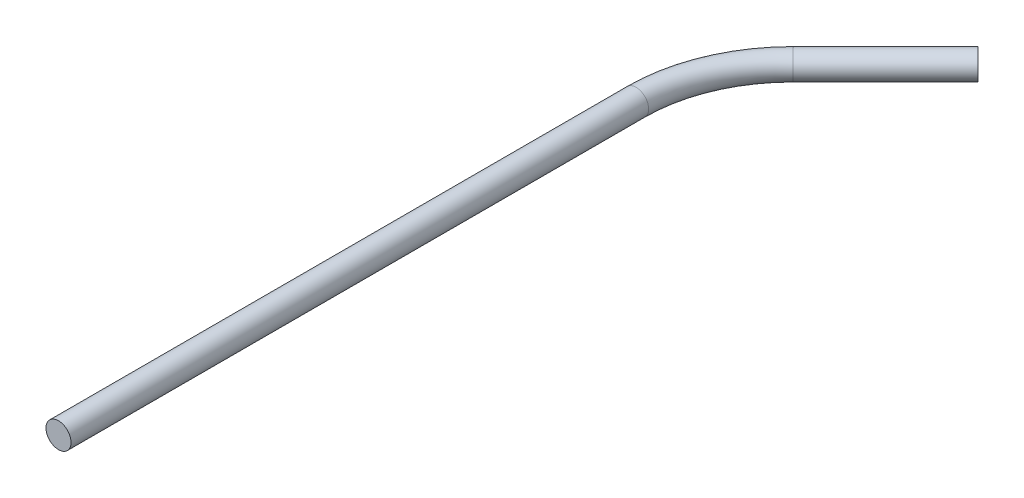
from build123d import *

# Parameters (mm, degrees)
SKETCH1_R = 0.8


with BuildPart() as part:
    # Sweep1: sweep along a path in Sketch2
    with BuildLine(Plane(origin=(0, 0, 0), x_dir=(1, 0, 0), z_dir=(0, 1, 0))) as sweep1_path:
        Line((0, 0), (0, 36.857864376))
        ThreePointArc((0, 36.857864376), (0.761204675, 40.6846987), (2.928932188, 43.928932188))
        Line((2.928932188, 43.928932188), (8.838834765, 49.838834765))
    # Sketch1 → Sweep1 (sweep)
    with BuildSketch(Plane.XY):
        Circle(SKETCH1_R)
    sweep(path=sweep1_path.line)


solid = part.part
